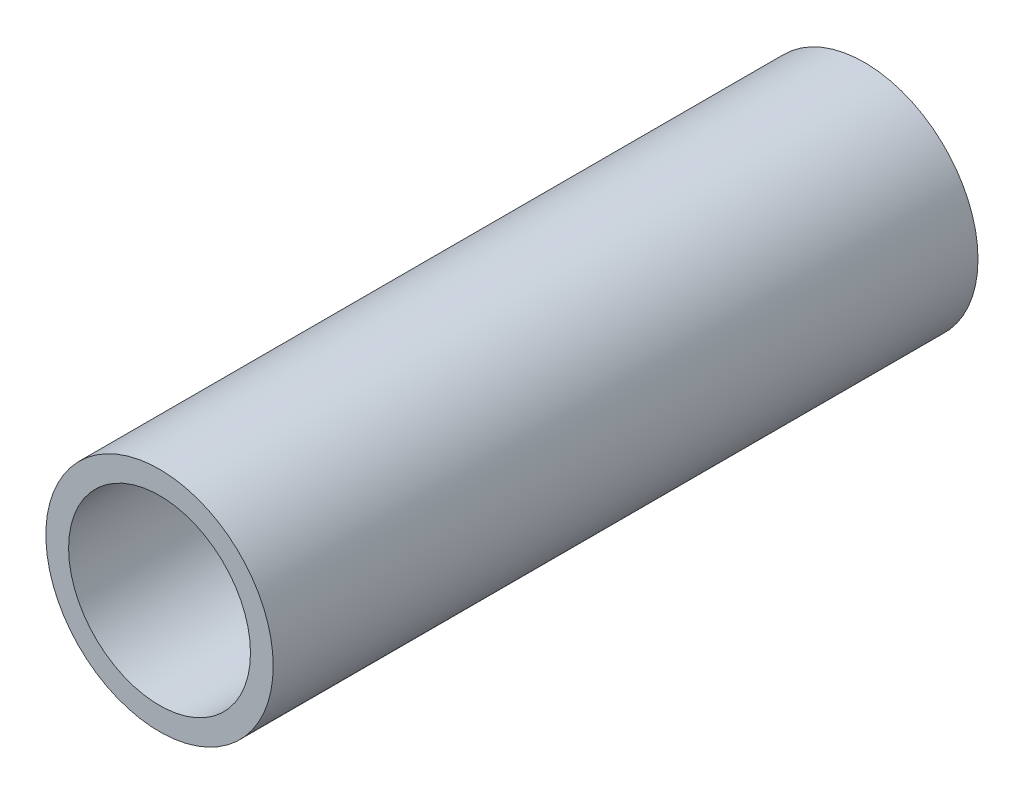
from build123d import *

# Parameters (mm, degrees)
SKETCH_1_R      = 5
SKETCH_1_R_2    = 4
EXTRUDE_1_DEPTH = 31


with BuildPart() as part:
    # Sketch 1 → Extrude 1 (new body)
    with BuildSketch(Plane.XY):
        Circle(SKETCH_1_R)
        Circle(SKETCH_1_R_2, mode=Mode.SUBTRACT)
    extrude(amount=EXTRUDE_1_DEPTH)


solid = part.part
